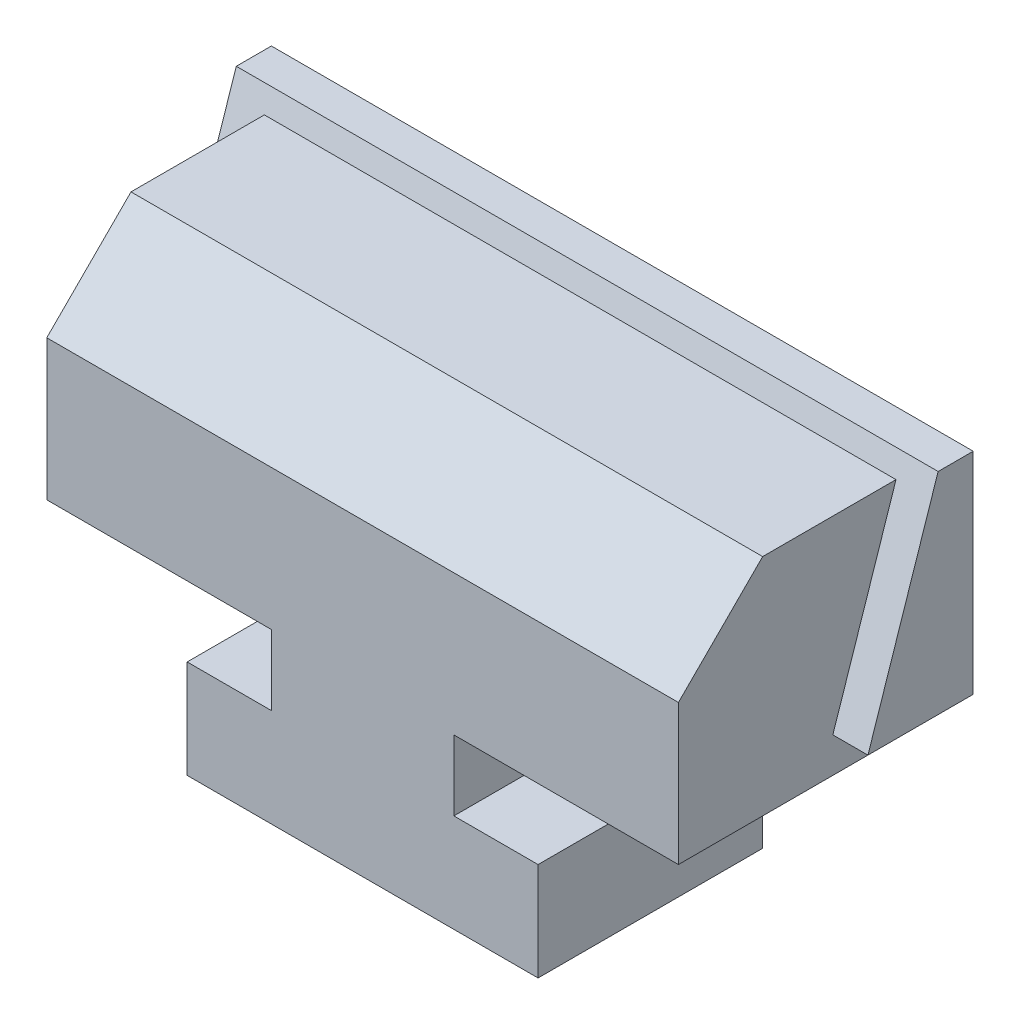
ISO-10303-21;
HEADER;
FILE_DESCRIPTION(('STEP AP214'),'2;1');
FILE_NAME('part.step','',(''),(''),'','','');
FILE_SCHEMA(('AUTOMOTIVE_DESIGN { 1 0 10303 214 1 1 1 1 }'));
ENDSEC;
DATA;
#1=APPLICATION_CONTEXT('core data for automotive mechanical design processes');
#2=APPLICATION_PROTOCOL_DEFINITION('international standard','automotive_design',2000,#1);
#3=PRODUCT_CONTEXT('',#1,'mechanical');
#4=PRODUCT('Part','Part','',(#3));
#5=PRODUCT_RELATED_PRODUCT_CATEGORY('part','',(#4));
#6=PRODUCT_DEFINITION_FORMATION('','',#4);
#7=PRODUCT_DEFINITION_CONTEXT('part definition',#1,'design');
#8=PRODUCT_DEFINITION('design','',#6,#7);
#9=PRODUCT_DEFINITION_SHAPE('','',#8);
#10=(LENGTH_UNIT() NAMED_UNIT(*) SI_UNIT(.MILLI.,.METRE.));
#11=(NAMED_UNIT(*) PLANE_ANGLE_UNIT() SI_UNIT($,.RADIAN.));
#12=(NAMED_UNIT(*) SI_UNIT($,.STERADIAN.) SOLID_ANGLE_UNIT());
#13=UNCERTAINTY_MEASURE_WITH_UNIT(LENGTH_MEASURE(1.E-05),#10,'distance_accuracy_value','');
#14=(GEOMETRIC_REPRESENTATION_CONTEXT(3) GLOBAL_UNCERTAINTY_ASSIGNED_CONTEXT((#13)) GLOBAL_UNIT_ASSIGNED_CONTEXT((#10,
#11,#12)) REPRESENTATION_CONTEXT('',''));
#15=CARTESIAN_POINT('',(0.,0.,0.));
#16=DIRECTION('',(0.,0.,1.));
#17=DIRECTION('',(1.,0.,0.));
#18=AXIS2_PLACEMENT_3D('',#15,#16,#17);
#19=CARTESIAN_POINT('',(-20.,56.,37.));
#20=DIRECTION('',(-1.,0.,0.));
#21=DIRECTION('',(0.,-1.,0.));
#22=AXIS2_PLACEMENT_3D('',#19,#20,#21);
#23=PLANE('',#22);
#24=DIRECTION('',(0.,0.,-1.));
#25=VECTOR('',#24,1.);
#26=CARTESIAN_POINT('',(-20.,56.,37.));
#27=LINE('',#26,#25);
#28=CARTESIAN_POINT('',(-20.,56.,25.));
#29=VERTEX_POINT('',#28);
#30=CARTESIAN_POINT('',(-20.,56.,6.));
#31=VERTEX_POINT('',#30);
#32=EDGE_CURVE('E292',#29,#31,#27,.T.);
#33=ORIENTED_EDGE('',*,*,#32,.F.);
#34=DIRECTION('',(0.,0.707106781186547,-0.707106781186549));
#35=VECTOR('',#34,1.);
#36=CARTESIAN_POINT('',(-20.,44.,37.));
#37=LINE('',#36,#35);
#38=CARTESIAN_POINT('',(-20.,44.,37.));
#39=VERTEX_POINT('',#38);
#40=EDGE_CURVE('E11',#29,#39,#37,.F.);
#41=ORIENTED_EDGE('',*,*,#40,.T.);
#42=DIRECTION('',(0.,1.,0.));
#43=VECTOR('',#42,1.);
#44=CARTESIAN_POINT('',(-20.,56.,37.));
#45=LINE('',#44,#43);
#46=CARTESIAN_POINT('',(-20.,24.,37.));
#47=VERTEX_POINT('',#46);
#48=EDGE_CURVE('E257',#47,#39,#45,.T.);
#49=ORIENTED_EDGE('',*,*,#48,.F.);
#50=DIRECTION('',(0.,0.,-1.));
#51=VECTOR('',#50,1.);
#52=CARTESIAN_POINT('',(-20.,24.,37.));
#53=LINE('',#52,#51);
#54=CARTESIAN_POINT('',(-20.,24.,4.99999999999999));
#55=VERTEX_POINT('',#54);
#56=EDGE_CURVE('E294',#47,#55,#53,.T.);
#57=ORIENTED_EDGE('',*,*,#56,.T.);
#58=DIRECTION('',(0.,1.,0.));
#59=VECTOR('',#58,1.);
#60=CARTESIAN_POINT('',(-20.,29.,4.99999999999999));
#61=LINE('',#60,#59);
#62=CARTESIAN_POINT('',(-20.,29.,4.99999999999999));
#63=VERTEX_POINT('',#62);
#64=EDGE_CURVE('E214',#55,#63,#61,.T.);
#65=ORIENTED_EDGE('',*,*,#64,.T.);
#66=DIRECTION('',(0.,0.,-1.));
#67=VECTOR('',#66,1.);
#68=CARTESIAN_POINT('',(-20.,29.,37.));
#69=LINE('',#68,#67);
#70=CARTESIAN_POINT('',(-20.,29.,15.));
#71=VERTEX_POINT('',#70);
#72=EDGE_CURVE('E204',#71,#63,#69,.T.);
#73=ORIENTED_EDGE('',*,*,#72,.F.);
#74=DIRECTION('',(0.,-0.948683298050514,0.316227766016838));
#75=VECTOR('',#74,1.);
#76=CARTESIAN_POINT('',(-20.,46.7,9.09999999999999));
#77=LINE('',#76,#75);
#78=EDGE_CURVE('E209',#31,#71,#77,.T.);
#79=ORIENTED_EDGE('',*,*,#78,.F.);
#80=EDGE_LOOP('',(#33,#41,#49,#57,#65,#73,#79));
#81=FACE_BOUND('',#80,.T.);
#82=ADVANCED_FACE('F28',(#81),#23,.F.);
#83=CARTESIAN_POINT('',(-110.,56.,37.));
#84=DIRECTION('',(0.,-1.,0.));
#85=DIRECTION('',(1.,0.,0.));
#86=AXIS2_PLACEMENT_3D('',#83,#84,#85);
#87=PLANE('',#86);
#88=DIRECTION('',(0.,0.,-1.));
#89=VECTOR('',#88,1.);
#90=CARTESIAN_POINT('',(-110.,56.,37.));
#91=LINE('',#90,#89);
#92=CARTESIAN_POINT('',(-110.,56.,25.));
#93=VERTEX_POINT('',#92);
#94=CARTESIAN_POINT('',(-110.,56.,5.99999999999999));
#95=VERTEX_POINT('',#94);
#96=EDGE_CURVE('E290',#93,#95,#91,.T.);
#97=ORIENTED_EDGE('',*,*,#96,.F.);
#98=DIRECTION('',(1.,0.,0.));
#99=VECTOR('',#98,1.);
#100=CARTESIAN_POINT('',(-110.,56.,25.));
#101=LINE('',#100,#99);
#102=EDGE_CURVE('E36',#93,#29,#101,.T.);
#103=ORIENTED_EDGE('',*,*,#102,.T.);
#104=ORIENTED_EDGE('',*,*,#32,.T.);
#105=DIRECTION('',(1.,0.,0.));
#106=VECTOR('',#105,1.);
#107=CARTESIAN_POINT('',(-110.,56.,6.));
#108=LINE('',#107,#106);
#109=EDGE_CURVE('E207',#95,#31,#108,.T.);
#110=ORIENTED_EDGE('',*,*,#109,.F.);
#111=EDGE_LOOP('',(#97,#103,#104,#110));
#112=FACE_BOUND('',#111,.T.);
#113=ADVANCED_FACE('F367',(#112),#87,.F.);
#114=CARTESIAN_POINT('',(-110.,24.,37.));
#115=DIRECTION('',(1.,0.,0.));
#116=DIRECTION('',(0.,0.,-1.));
#117=AXIS2_PLACEMENT_3D('',#114,#115,#116);
#118=PLANE('',#117);
#119=DIRECTION('',(0.,-1.,0.));
#120=VECTOR('',#119,1.);
#121=CARTESIAN_POINT('',(-110.,24.,37.));
#122=LINE('',#121,#120);
#123=CARTESIAN_POINT('',(-110.,44.,37.));
#124=VERTEX_POINT('',#123);
#125=CARTESIAN_POINT('',(-110.,24.,37.));
#126=VERTEX_POINT('',#125);
#127=EDGE_CURVE('E260',#124,#126,#122,.T.);
#128=ORIENTED_EDGE('',*,*,#127,.F.);
#129=DIRECTION('',(0.,-0.707106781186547,0.707106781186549));
#130=VECTOR('',#129,1.);
#131=CARTESIAN_POINT('',(-110.,44.,37.));
#132=LINE('',#131,#130);
#133=EDGE_CURVE('E50',#124,#93,#132,.F.);
#134=ORIENTED_EDGE('',*,*,#133,.T.);
#135=ORIENTED_EDGE('',*,*,#96,.T.);
#136=DIRECTION('',(0.,0.948683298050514,-0.316227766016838));
#137=VECTOR('',#136,1.);
#138=CARTESIAN_POINT('',(-110.,17.9,18.7));
#139=LINE('',#138,#137);
#140=CARTESIAN_POINT('',(-110.,29.,15.));
#141=VERTEX_POINT('',#140);
#142=EDGE_CURVE('E306',#141,#95,#139,.T.);
#143=ORIENTED_EDGE('',*,*,#142,.F.);
#144=DIRECTION('',(0.,0.,1.));
#145=VECTOR('',#144,1.);
#146=CARTESIAN_POINT('',(-110.,29.,37.));
#147=LINE('',#146,#145);
#148=CARTESIAN_POINT('',(-110.,29.,4.99999999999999));
#149=VERTEX_POINT('',#148);
#150=EDGE_CURVE('E167',#149,#141,#147,.T.);
#151=ORIENTED_EDGE('',*,*,#150,.F.);
#152=DIRECTION('',(0.,1.,0.));
#153=VECTOR('',#152,1.);
#154=CARTESIAN_POINT('',(-110.,29.,4.99999999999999));
#155=LINE('',#154,#153);
#156=CARTESIAN_POINT('',(-110.,24.,4.99999999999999));
#157=VERTEX_POINT('',#156);
#158=EDGE_CURVE('E211',#157,#149,#155,.T.);
#159=ORIENTED_EDGE('',*,*,#158,.F.);
#160=DIRECTION('',(0.,0.,-1.));
#161=VECTOR('',#160,1.);
#162=CARTESIAN_POINT('',(-110.,24.,37.));
#163=LINE('',#162,#161);
#164=EDGE_CURVE('E287',#126,#157,#163,.T.);
#165=ORIENTED_EDGE('',*,*,#164,.F.);
#166=EDGE_LOOP('',(#128,#134,#135,#143,#151,#159,#165));
#167=FACE_BOUND('',#166,.T.);
#168=ADVANCED_FACE('F319',(#167),#118,.F.);
#169=CARTESIAN_POINT('',(-40.,14.,37.));
#170=DIRECTION('',(-1.,0.,0.));
#171=DIRECTION('',(0.,-1.,0.));
#172=AXIS2_PLACEMENT_3D('',#169,#170,#171);
#173=PLANE('',#172);
#174=DIRECTION('',(0.,0.,-1.));
#175=VECTOR('',#174,1.);
#176=CARTESIAN_POINT('',(-40.,0.,37.));
#177=LINE('',#176,#175);
#178=CARTESIAN_POINT('',(-40.,0.,37.));
#179=VERTEX_POINT('',#178);
#180=CARTESIAN_POINT('',(-40.,0.,5.));
#181=VERTEX_POINT('',#180);
#182=EDGE_CURVE('E272',#179,#181,#177,.T.);
#183=ORIENTED_EDGE('',*,*,#182,.T.);
#184=DIRECTION('',(0.,1.,0.));
#185=VECTOR('',#184,1.);
#186=CARTESIAN_POINT('',(-40.,14.,5.));
#187=LINE('',#186,#185);
#188=CARTESIAN_POINT('',(-40.,14.,5.));
#189=VERTEX_POINT('',#188);
#190=EDGE_CURVE('E245',#181,#189,#187,.T.);
#191=ORIENTED_EDGE('',*,*,#190,.T.);
#192=DIRECTION('',(0.,0.,-1.));
#193=VECTOR('',#192,1.);
#194=CARTESIAN_POINT('',(-40.,14.,37.));
#195=LINE('',#194,#193);
#196=CARTESIAN_POINT('',(-40.,14.,37.));
#197=VERTEX_POINT('',#196);
#198=EDGE_CURVE('E303',#197,#189,#195,.T.);
#199=ORIENTED_EDGE('',*,*,#198,.F.);
#200=DIRECTION('',(0.,1.,0.));
#201=VECTOR('',#200,1.);
#202=CARTESIAN_POINT('',(-40.,14.,37.));
#203=LINE('',#202,#201);
#204=EDGE_CURVE('E248',#179,#197,#203,.T.);
#205=ORIENTED_EDGE('',*,*,#204,.F.);
#206=EDGE_LOOP('',(#183,#191,#199,#205));
#207=FACE_BOUND('',#206,.T.);
#208=ADVANCED_FACE('F30',(#207),#173,.F.);
#209=CARTESIAN_POINT('',(-52.,14.,37.));
#210=DIRECTION('',(0.,-1.,0.));
#211=DIRECTION('',(0.,0.,-1.));
#212=AXIS2_PLACEMENT_3D('',#209,#210,#211);
#213=PLANE('',#212);
#214=ORIENTED_EDGE('',*,*,#198,.T.);
#215=DIRECTION('',(-1.,0.,0.));
#216=VECTOR('',#215,1.);
#217=CARTESIAN_POINT('',(-52.,14.,5.));
#218=LINE('',#217,#216);
#219=CARTESIAN_POINT('',(-52.,14.,4.99999999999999));
#220=VERTEX_POINT('',#219);
#221=EDGE_CURVE('E242',#189,#220,#218,.T.);
#222=ORIENTED_EDGE('',*,*,#221,.T.);
#223=DIRECTION('',(0.,0.,-1.));
#224=VECTOR('',#223,1.);
#225=CARTESIAN_POINT('',(-52.,14.,37.));
#226=LINE('',#225,#224);
#227=CARTESIAN_POINT('',(-52.,14.,37.));
#228=VERTEX_POINT('',#227);
#229=EDGE_CURVE('E300',#228,#220,#226,.T.);
#230=ORIENTED_EDGE('',*,*,#229,.F.);
#231=DIRECTION('',(-1.,0.,0.));
#232=VECTOR('',#231,1.);
#233=CARTESIAN_POINT('',(-52.,14.,37.));
#234=LINE('',#233,#232);
#235=EDGE_CURVE('E251',#197,#228,#234,.T.);
#236=ORIENTED_EDGE('',*,*,#235,.F.);
#237=EDGE_LOOP('',(#214,#222,#230,#236));
#238=FACE_BOUND('',#237,.T.);
#239=ADVANCED_FACE('F346',(#238),#213,.F.);
#240=CARTESIAN_POINT('',(-52.,24.,37.));
#241=DIRECTION('',(-1.,0.,0.));
#242=DIRECTION('',(0.,0.,1.));
#243=AXIS2_PLACEMENT_3D('',#240,#241,#242);
#244=PLANE('',#243);
#245=ORIENTED_EDGE('',*,*,#229,.T.);
#246=DIRECTION('',(0.,1.,0.));
#247=VECTOR('',#246,1.);
#248=CARTESIAN_POINT('',(-52.,24.,4.99999999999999));
#249=LINE('',#248,#247);
#250=CARTESIAN_POINT('',(-52.,24.,4.99999999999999));
#251=VERTEX_POINT('',#250);
#252=EDGE_CURVE('E239',#220,#251,#249,.T.);
#253=ORIENTED_EDGE('',*,*,#252,.T.);
#254=DIRECTION('',(0.,0.,-1.));
#255=VECTOR('',#254,1.);
#256=CARTESIAN_POINT('',(-52.,24.,37.));
#257=LINE('',#256,#255);
#258=CARTESIAN_POINT('',(-52.,24.,37.));
#259=VERTEX_POINT('',#258);
#260=EDGE_CURVE('E297',#259,#251,#257,.T.);
#261=ORIENTED_EDGE('',*,*,#260,.F.);
#262=DIRECTION('',(0.,1.,0.));
#263=VECTOR('',#262,1.);
#264=CARTESIAN_POINT('',(-52.,24.,37.));
#265=LINE('',#264,#263);
#266=EDGE_CURVE('E253',#228,#259,#265,.T.);
#267=ORIENTED_EDGE('',*,*,#266,.F.);
#268=EDGE_LOOP('',(#245,#253,#261,#267));
#269=FACE_BOUND('',#268,.T.);
#270=ADVANCED_FACE('F353',(#269),#244,.F.);
#271=CARTESIAN_POINT('',(-20.,24.,37.));
#272=DIRECTION('',(0.,1.,0.));
#273=DIRECTION('',(-1.,0.,0.));
#274=AXIS2_PLACEMENT_3D('',#271,#272,#273);
#275=PLANE('',#274);
#276=ORIENTED_EDGE('',*,*,#260,.T.);
#277=DIRECTION('',(1.,0.,0.));
#278=VECTOR('',#277,1.);
#279=CARTESIAN_POINT('',(-20.,24.,4.99999999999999));
#280=LINE('',#279,#278);
#281=EDGE_CURVE('E236',#251,#55,#280,.T.);
#282=ORIENTED_EDGE('',*,*,#281,.T.);
#283=ORIENTED_EDGE('',*,*,#56,.F.);
#284=DIRECTION('',(1.,0.,0.));
#285=VECTOR('',#284,1.);
#286=CARTESIAN_POINT('',(-20.,24.,37.));
#287=LINE('',#286,#285);
#288=EDGE_CURVE('E255',#259,#47,#287,.T.);
#289=ORIENTED_EDGE('',*,*,#288,.F.);
#290=EDGE_LOOP('',(#276,#282,#283,#289));
#291=FACE_BOUND('',#290,.T.);
#292=ADVANCED_FACE('F355',(#291),#275,.F.);
#293=CARTESIAN_POINT('',(-78.,24.,37.));
#294=DIRECTION('',(0.,1.,0.));
#295=DIRECTION('',(-1.,0.,0.));
#296=AXIS2_PLACEMENT_3D('',#293,#294,#295);
#297=PLANE('',#296);
#298=ORIENTED_EDGE('',*,*,#164,.T.);
#299=DIRECTION('',(1.,0.,0.));
#300=VECTOR('',#299,1.);
#301=CARTESIAN_POINT('',(-78.,24.,4.99999999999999));
#302=LINE('',#301,#300);
#303=CARTESIAN_POINT('',(-78.,24.,4.99999999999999));
#304=VERTEX_POINT('',#303);
#305=EDGE_CURVE('E233',#157,#304,#302,.T.);
#306=ORIENTED_EDGE('',*,*,#305,.T.);
#307=DIRECTION('',(0.,0.,-1.));
#308=VECTOR('',#307,1.);
#309=CARTESIAN_POINT('',(-78.,24.,37.));
#310=LINE('',#309,#308);
#311=CARTESIAN_POINT('',(-78.,24.,37.));
#312=VERTEX_POINT('',#311);
#313=EDGE_CURVE('E284',#312,#304,#310,.T.);
#314=ORIENTED_EDGE('',*,*,#313,.F.);
#315=DIRECTION('',(1.,0.,0.));
#316=VECTOR('',#315,1.);
#317=CARTESIAN_POINT('',(-78.,24.,37.));
#318=LINE('',#317,#316);
#319=EDGE_CURVE('E262',#126,#312,#318,.T.);
#320=ORIENTED_EDGE('',*,*,#319,.F.);
#321=EDGE_LOOP('',(#298,#306,#314,#320));
#322=FACE_BOUND('',#321,.T.);
#323=ADVANCED_FACE('F324',(#322),#297,.F.);
#324=CARTESIAN_POINT('',(-78.,14.,37.));
#325=DIRECTION('',(1.,0.,0.));
#326=DIRECTION('',(0.,0.,-1.));
#327=AXIS2_PLACEMENT_3D('',#324,#325,#326);
#328=PLANE('',#327);
#329=ORIENTED_EDGE('',*,*,#313,.T.);
#330=DIRECTION('',(0.,-1.,0.));
#331=VECTOR('',#330,1.);
#332=CARTESIAN_POINT('',(-78.,14.,5.));
#333=LINE('',#332,#331);
#334=CARTESIAN_POINT('',(-78.,14.,5.));
#335=VERTEX_POINT('',#334);
#336=EDGE_CURVE('E230',#304,#335,#333,.T.);
#337=ORIENTED_EDGE('',*,*,#336,.T.);
#338=DIRECTION('',(0.,0.,-1.));
#339=VECTOR('',#338,1.);
#340=CARTESIAN_POINT('',(-78.,14.,37.));
#341=LINE('',#340,#339);
#342=CARTESIAN_POINT('',(-78.,14.,37.));
#343=VERTEX_POINT('',#342);
#344=EDGE_CURVE('E281',#343,#335,#341,.T.);
#345=ORIENTED_EDGE('',*,*,#344,.F.);
#346=DIRECTION('',(0.,-1.,0.));
#347=VECTOR('',#346,1.);
#348=CARTESIAN_POINT('',(-78.,14.,37.));
#349=LINE('',#348,#347);
#350=EDGE_CURVE('E264',#312,#343,#349,.T.);
#351=ORIENTED_EDGE('',*,*,#350,.F.);
#352=EDGE_LOOP('',(#329,#337,#345,#351));
#353=FACE_BOUND('',#352,.T.);
#354=ADVANCED_FACE('F330',(#353),#328,.F.);
#355=CARTESIAN_POINT('',(-90.,14.,37.));
#356=DIRECTION('',(0.,-1.,0.));
#357=DIRECTION('',(0.,0.,-1.));
#358=AXIS2_PLACEMENT_3D('',#355,#356,#357);
#359=PLANE('',#358);
#360=ORIENTED_EDGE('',*,*,#344,.T.);
#361=DIRECTION('',(-1.,0.,0.));
#362=VECTOR('',#361,1.);
#363=CARTESIAN_POINT('',(-90.,14.,5.));
#364=LINE('',#363,#362);
#365=CARTESIAN_POINT('',(-90.,14.,5.));
#366=VERTEX_POINT('',#365);
#367=EDGE_CURVE('E227',#335,#366,#364,.T.);
#368=ORIENTED_EDGE('',*,*,#367,.T.);
#369=DIRECTION('',(0.,0.,-1.));
#370=VECTOR('',#369,1.);
#371=CARTESIAN_POINT('',(-90.,14.,37.));
#372=LINE('',#371,#370);
#373=CARTESIAN_POINT('',(-90.,14.,37.));
#374=VERTEX_POINT('',#373);
#375=EDGE_CURVE('E278',#374,#366,#372,.T.);
#376=ORIENTED_EDGE('',*,*,#375,.F.);
#377=DIRECTION('',(-1.,0.,0.));
#378=VECTOR('',#377,1.);
#379=CARTESIAN_POINT('',(-90.,14.,37.));
#380=LINE('',#379,#378);
#381=EDGE_CURVE('E266',#343,#374,#380,.T.);
#382=ORIENTED_EDGE('',*,*,#381,.F.);
#383=EDGE_LOOP('',(#360,#368,#376,#382));
#384=FACE_BOUND('',#383,.T.);
#385=ADVANCED_FACE('F332',(#384),#359,.F.);
#386=CARTESIAN_POINT('',(-90.,0.,37.));
#387=DIRECTION('',(1.,0.,0.));
#388=DIRECTION('',(0.,0.,-1.));
#389=AXIS2_PLACEMENT_3D('',#386,#387,#388);
#390=PLANE('',#389);
#391=ORIENTED_EDGE('',*,*,#375,.T.);
#392=DIRECTION('',(0.,-1.,0.));
#393=VECTOR('',#392,1.);
#394=CARTESIAN_POINT('',(-90.,0.,5.));
#395=LINE('',#394,#393);
#396=CARTESIAN_POINT('',(-90.,0.,5.));
#397=VERTEX_POINT('',#396);
#398=EDGE_CURVE('E220',#366,#397,#395,.T.);
#399=ORIENTED_EDGE('',*,*,#398,.T.);
#400=DIRECTION('',(0.,0.,-1.));
#401=VECTOR('',#400,1.);
#402=CARTESIAN_POINT('',(-90.,0.,37.));
#403=LINE('',#402,#401);
#404=CARTESIAN_POINT('',(-90.,0.,37.));
#405=VERTEX_POINT('',#404);
#406=EDGE_CURVE('E275',#405,#397,#403,.T.);
#407=ORIENTED_EDGE('',*,*,#406,.F.);
#408=DIRECTION('',(0.,-1.,0.));
#409=VECTOR('',#408,1.);
#410=CARTESIAN_POINT('',(-90.,0.,37.));
#411=LINE('',#410,#409);
#412=EDGE_CURVE('E268',#374,#405,#411,.T.);
#413=ORIENTED_EDGE('',*,*,#412,.F.);
#414=EDGE_LOOP('',(#391,#399,#407,#413));
#415=FACE_BOUND('',#414,.T.);
#416=ADVANCED_FACE('F336',(#415),#390,.F.);
#417=CARTESIAN_POINT('',(-40.,0.,37.));
#418=DIRECTION('',(0.,1.,0.));
#419=DIRECTION('',(0.,0.,1.));
#420=AXIS2_PLACEMENT_3D('',#417,#418,#419);
#421=PLANE('',#420);
#422=ORIENTED_EDGE('',*,*,#406,.T.);
#423=DIRECTION('',(-1.,0.,0.));
#424=VECTOR('',#423,1.);
#425=CARTESIAN_POINT('',(-20.,0.,5.));
#426=LINE('',#425,#424);
#427=EDGE_CURVE('E217',#181,#397,#426,.T.);
#428=ORIENTED_EDGE('',*,*,#427,.F.);
#429=ORIENTED_EDGE('',*,*,#182,.F.);
#430=DIRECTION('',(1.,0.,0.));
#431=VECTOR('',#430,1.);
#432=CARTESIAN_POINT('',(-40.,0.,37.));
#433=LINE('',#432,#431);
#434=EDGE_CURVE('E270',#405,#179,#433,.T.);
#435=ORIENTED_EDGE('',*,*,#434,.F.);
#436=EDGE_LOOP('',(#422,#428,#429,#435));
#437=FACE_BOUND('',#436,.T.);
#438=ADVANCED_FACE('F343',(#437),#421,.F.);
#439=CARTESIAN_POINT('',(-40.,24.,37.));
#440=DIRECTION('',(0.,0.,-1.));
#441=DIRECTION('',(-1.,0.,0.));
#442=AXIS2_PLACEMENT_3D('',#439,#440,#441);
#443=PLANE('',#442);
#444=ORIENTED_EDGE('',*,*,#48,.T.);
#445=DIRECTION('',(-1.,0.,0.));
#446=VECTOR('',#445,1.);
#447=CARTESIAN_POINT('',(-40.,44.,37.));
#448=LINE('',#447,#446);
#449=EDGE_CURVE('E309',#39,#124,#448,.T.);
#450=ORIENTED_EDGE('',*,*,#449,.T.);
#451=ORIENTED_EDGE('',*,*,#127,.T.);
#452=ORIENTED_EDGE('',*,*,#319,.T.);
#453=ORIENTED_EDGE('',*,*,#350,.T.);
#454=ORIENTED_EDGE('',*,*,#381,.T.);
#455=ORIENTED_EDGE('',*,*,#412,.T.);
#456=ORIENTED_EDGE('',*,*,#434,.T.);
#457=ORIENTED_EDGE('',*,*,#204,.T.);
#458=ORIENTED_EDGE('',*,*,#235,.T.);
#459=ORIENTED_EDGE('',*,*,#266,.T.);
#460=ORIENTED_EDGE('',*,*,#288,.T.);
#461=EDGE_LOOP('',(#444,#450,#451,#452,#453,#454,#455,#456,#457,#458,#459,#460));
#462=FACE_BOUND('',#461,.T.);
#463=ADVANCED_FACE('F314',(#462),#443,.F.);
#464=CARTESIAN_POINT('',(-40.,24.,0.));
#465=DIRECTION('',(0.,0.,-1.));
#466=DIRECTION('',(-1.,0.,0.));
#467=AXIS2_PLACEMENT_3D('',#464,#465,#466);
#468=PLANE('',#467);
#469=DIRECTION('',(-1.,0.,0.));
#470=VECTOR('',#469,1.);
#471=CARTESIAN_POINT('',(-20.,29.,0.));
#472=LINE('',#471,#470);
#473=CARTESIAN_POINT('',(-15.,29.,0.));
#474=VERTEX_POINT('',#473);
#475=CARTESIAN_POINT('',(-115.,29.,0.));
#476=VERTEX_POINT('',#475);
#477=EDGE_CURVE('E218',#474,#476,#472,.T.);
#478=ORIENTED_EDGE('',*,*,#477,.T.);
#479=DIRECTION('',(0.,-1.,0.));
#480=VECTOR('',#479,1.);
#481=CARTESIAN_POINT('',(-115.,29.,0.));
#482=LINE('',#481,#480);
#483=CARTESIAN_POINT('',(-115.,59.,0.));
#484=VERTEX_POINT('',#483);
#485=EDGE_CURVE('E193',#484,#476,#482,.T.);
#486=ORIENTED_EDGE('',*,*,#485,.F.);
#487=DIRECTION('',(1.,0.,0.));
#488=VECTOR('',#487,1.);
#489=CARTESIAN_POINT('',(-115.,59.,0.));
#490=LINE('',#489,#488);
#491=CARTESIAN_POINT('',(-15.,59.,0.));
#492=VERTEX_POINT('',#491);
#493=EDGE_CURVE('E168',#484,#492,#490,.T.);
#494=ORIENTED_EDGE('',*,*,#493,.T.);
#495=DIRECTION('',(0.,-1.,0.));
#496=VECTOR('',#495,1.);
#497=CARTESIAN_POINT('',(-15.,29.,0.));
#498=LINE('',#497,#496);
#499=EDGE_CURVE('E178',#492,#474,#498,.T.);
#500=ORIENTED_EDGE('',*,*,#499,.T.);
#501=EDGE_LOOP('',(#478,#486,#494,#500));
#502=FACE_BOUND('',#501,.T.);
#503=ADVANCED_FACE('F400',(#502),#468,.T.);
#504=CARTESIAN_POINT('',(-20.,29.,4.99999999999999));
#505=DIRECTION('',(0.,0.,1.));
#506=DIRECTION('',(0.,-1.,0.));
#507=AXIS2_PLACEMENT_3D('',#504,#505,#506);
#508=PLANE('',#507);
#509=ORIENTED_EDGE('',*,*,#427,.T.);
#510=ORIENTED_EDGE('',*,*,#398,.F.);
#511=ORIENTED_EDGE('',*,*,#367,.F.);
#512=ORIENTED_EDGE('',*,*,#336,.F.);
#513=ORIENTED_EDGE('',*,*,#305,.F.);
#514=ORIENTED_EDGE('',*,*,#158,.T.);
#515=DIRECTION('',(-1.,0.,0.));
#516=VECTOR('',#515,1.);
#517=CARTESIAN_POINT('',(-20.,29.,4.99999999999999));
#518=LINE('',#517,#516);
#519=EDGE_CURVE('E221',#63,#149,#518,.T.);
#520=ORIENTED_EDGE('',*,*,#519,.F.);
#521=ORIENTED_EDGE('',*,*,#64,.F.);
#522=ORIENTED_EDGE('',*,*,#281,.F.);
#523=ORIENTED_EDGE('',*,*,#252,.F.);
#524=ORIENTED_EDGE('',*,*,#221,.F.);
#525=ORIENTED_EDGE('',*,*,#190,.F.);
#526=EDGE_LOOP('',(#509,#510,#511,#512,#513,#514,#520,#521,#522,#523,#524,#525));
#527=FACE_BOUND('',#526,.T.);
#528=ADVANCED_FACE('F403',(#527),#508,.F.);
#529=CARTESIAN_POINT('',(-20.,29.,0.));
#530=DIRECTION('',(0.,1.,0.));
#531=DIRECTION('',(0.,0.,1.));
#532=AXIS2_PLACEMENT_3D('',#529,#530,#531);
#533=PLANE('',#532);
#534=ORIENTED_EDGE('',*,*,#519,.T.);
#535=ORIENTED_EDGE('',*,*,#150,.T.);
#536=DIRECTION('',(1.,0.,0.));
#537=VECTOR('',#536,1.);
#538=CARTESIAN_POINT('',(-115.,29.,15.));
#539=LINE('',#538,#537);
#540=CARTESIAN_POINT('',(-115.,29.,15.));
#541=VERTEX_POINT('',#540);
#542=EDGE_CURVE('E198',#541,#141,#539,.T.);
#543=ORIENTED_EDGE('',*,*,#542,.F.);
#544=DIRECTION('',(0.,0.,1.));
#545=VECTOR('',#544,1.);
#546=CARTESIAN_POINT('',(-115.,29.,15.));
#547=LINE('',#546,#545);
#548=EDGE_CURVE('E196',#476,#541,#547,.T.);
#549=ORIENTED_EDGE('',*,*,#548,.F.);
#550=ORIENTED_EDGE('',*,*,#477,.F.);
#551=DIRECTION('',(0.,0.,1.));
#552=VECTOR('',#551,1.);
#553=CARTESIAN_POINT('',(-15.,29.,15.));
#554=LINE('',#553,#552);
#555=CARTESIAN_POINT('',(-15.,29.,15.));
#556=VERTEX_POINT('',#555);
#557=EDGE_CURVE('E188',#474,#556,#554,.T.);
#558=ORIENTED_EDGE('',*,*,#557,.T.);
#559=EDGE_CURVE('E184',#71,#556,#539,.T.);
#560=ORIENTED_EDGE('',*,*,#559,.F.);
#561=ORIENTED_EDGE('',*,*,#72,.T.);
#562=EDGE_LOOP('',(#534,#535,#543,#549,#550,#558,#560,#561));
#563=FACE_BOUND('',#562,.T.);
#564=ADVANCED_FACE('F407',(#563),#533,.F.);
#565=CARTESIAN_POINT('',(-115.,59.,5.));
#566=DIRECTION('',(0.,-0.316227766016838,-0.948683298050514));
#567=DIRECTION('',(0.,0.948683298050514,-0.316227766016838));
#568=AXIS2_PLACEMENT_3D('',#565,#566,#567);
#569=PLANE('',#568);
#570=ORIENTED_EDGE('',*,*,#109,.T.);
#571=ORIENTED_EDGE('',*,*,#78,.T.);
#572=ORIENTED_EDGE('',*,*,#559,.T.);
#573=DIRECTION('',(0.,0.948683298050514,-0.316227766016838));
#574=VECTOR('',#573,1.);
#575=CARTESIAN_POINT('',(-15.,59.,5.));
#576=LINE('',#575,#574);
#577=CARTESIAN_POINT('',(-15.,59.,5.));
#578=VERTEX_POINT('',#577);
#579=EDGE_CURVE('E175',#556,#578,#576,.T.);
#580=ORIENTED_EDGE('',*,*,#579,.T.);
#581=DIRECTION('',(1.,0.,0.));
#582=VECTOR('',#581,1.);
#583=CARTESIAN_POINT('',(-115.,59.,5.));
#584=LINE('',#583,#582);
#585=CARTESIAN_POINT('',(-115.,59.,5.));
#586=VERTEX_POINT('',#585);
#587=EDGE_CURVE('E157',#586,#578,#584,.T.);
#588=ORIENTED_EDGE('',*,*,#587,.F.);
#589=DIRECTION('',(0.,0.948683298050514,-0.316227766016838));
#590=VECTOR('',#589,1.);
#591=CARTESIAN_POINT('',(-115.,59.,5.));
#592=LINE('',#591,#590);
#593=EDGE_CURVE('E190',#541,#586,#592,.T.);
#594=ORIENTED_EDGE('',*,*,#593,.F.);
#595=ORIENTED_EDGE('',*,*,#542,.T.);
#596=ORIENTED_EDGE('',*,*,#142,.T.);
#597=EDGE_LOOP('',(#570,#571,#572,#580,#588,#594,#595,#596));
#598=FACE_BOUND('',#597,.T.);
#599=ADVANCED_FACE('F181',(#598),#569,.F.);
#600=CARTESIAN_POINT('',(-115.,59.,0.));
#601=DIRECTION('',(0.,-1.,0.));
#602=DIRECTION('',(0.,0.,-1.));
#603=AXIS2_PLACEMENT_3D('',#600,#601,#602);
#604=PLANE('',#603);
#605=ORIENTED_EDGE('',*,*,#587,.T.);
#606=DIRECTION('',(0.,0.,-1.));
#607=VECTOR('',#606,1.);
#608=CARTESIAN_POINT('',(-15.,59.,0.));
#609=LINE('',#608,#607);
#610=EDGE_CURVE('E161',#578,#492,#609,.T.);
#611=ORIENTED_EDGE('',*,*,#610,.T.);
#612=ORIENTED_EDGE('',*,*,#493,.F.);
#613=DIRECTION('',(0.,0.,-1.));
#614=VECTOR('',#613,1.);
#615=CARTESIAN_POINT('',(-115.,59.,0.));
#616=LINE('',#615,#614);
#617=EDGE_CURVE('E162',#586,#484,#616,.T.);
#618=ORIENTED_EDGE('',*,*,#617,.F.);
#619=EDGE_LOOP('',(#605,#611,#612,#618));
#620=FACE_BOUND('',#619,.T.);
#621=ADVANCED_FACE('F159',(#620),#604,.F.);
#622=CARTESIAN_POINT('',(-115.,29.,15.));
#623=DIRECTION('',(1.,0.,0.));
#624=DIRECTION('',(0.,0.,-1.));
#625=AXIS2_PLACEMENT_3D('',#622,#623,#624);
#626=PLANE('',#625);
#627=ORIENTED_EDGE('',*,*,#593,.T.);
#628=ORIENTED_EDGE('',*,*,#617,.T.);
#629=ORIENTED_EDGE('',*,*,#485,.T.);
#630=ORIENTED_EDGE('',*,*,#548,.T.);
#631=EDGE_LOOP('',(#627,#628,#629,#630));
#632=FACE_BOUND('',#631,.T.);
#633=ADVANCED_FACE('F364',(#632),#626,.F.);
#634=CARTESIAN_POINT('',(-15.,29.,15.));
#635=DIRECTION('',(1.,0.,0.));
#636=DIRECTION('',(0.,0.,-1.));
#637=AXIS2_PLACEMENT_3D('',#634,#635,#636);
#638=PLANE('',#637);
#639=ORIENTED_EDGE('',*,*,#579,.F.);
#640=ORIENTED_EDGE('',*,*,#557,.F.);
#641=ORIENTED_EDGE('',*,*,#499,.F.);
#642=ORIENTED_EDGE('',*,*,#610,.F.);
#643=EDGE_LOOP('',(#639,#640,#641,#642));
#644=FACE_BOUND('',#643,.T.);
#645=ADVANCED_FACE('F173',(#644),#638,.T.);
#646=CARTESIAN_POINT('',(-40.,44.,37.));
#647=DIRECTION('',(0.,-0.707106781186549,-0.707106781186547));
#648=DIRECTION('',(0.,0.707106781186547,-0.707106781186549));
#649=AXIS2_PLACEMENT_3D('',#646,#647,#648);
#650=PLANE('',#649);
#651=ORIENTED_EDGE('',*,*,#40,.F.);
#652=ORIENTED_EDGE('',*,*,#102,.F.);
#653=ORIENTED_EDGE('',*,*,#133,.F.);
#654=ORIENTED_EDGE('',*,*,#449,.F.);
#655=EDGE_LOOP('',(#651,#652,#653,#654));
#656=FACE_BOUND('',#655,.T.);
#657=ADVANCED_FACE('F358',(#656),#650,.F.);
#658=CLOSED_SHELL('',(#82,#113,#168,#208,#239,#270,#292,#323,#354,#385,#416,#438,#463,#503,#528,
#564,#599,#621,#633,#645,#657));
#659=MANIFOLD_SOLID_BREP('B2',#658);
#660=ADVANCED_BREP_SHAPE_REPRESENTATION('',(#18,#659),#14);
#661=SHAPE_DEFINITION_REPRESENTATION(#9,#660);
ENDSEC;
END-ISO-10303-21;
